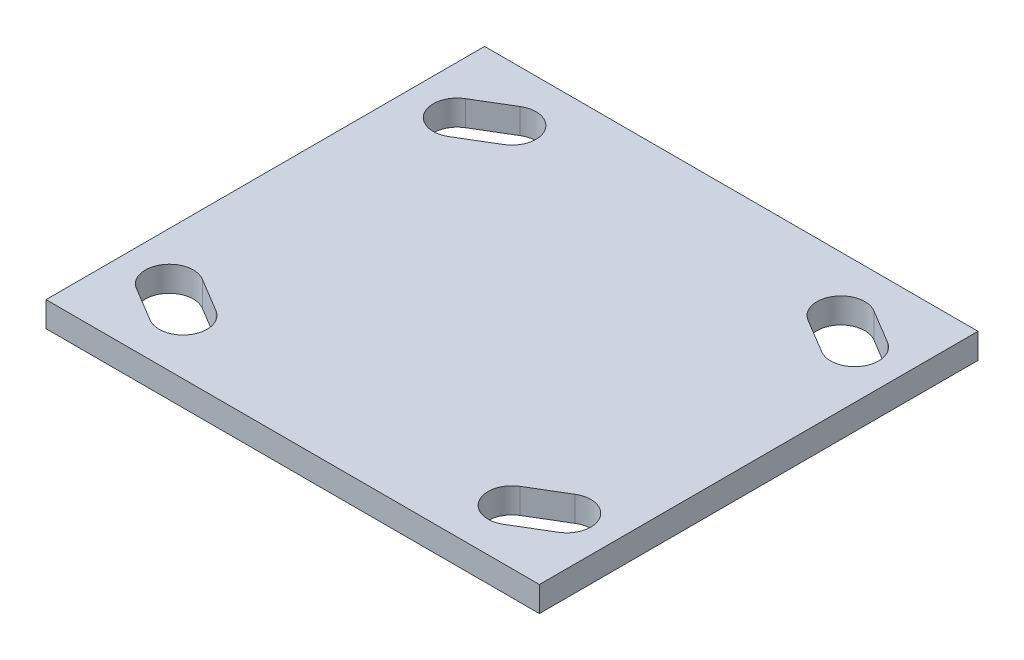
from build123d import *

# Parameters (mm, degrees)
SKETCH1_W          = 114.3
SKETCH1_H          = 101.6
EXTRUDE1_DEPTH     = 2.921
CUT_EXTRUDE1_DEPTH = 5.842


with BuildPart() as part:
    # Sketch1 → Extrude1 (new, symmetric)
    with BuildSketch(Plane(origin=(0, 0, 0), x_dir=(1, 0, 0), z_dir=(0, 1, 0))):
        Rectangle(SKETCH1_W, SKETCH1_H)
    extrude(amount=EXTRUDE1_DEPTH, both=True)

    # Sketch2 → Cut-Extrude1 (cut)
    with BuildSketch(Plane(origin=(0, 2.921, 0), x_dir=(-1, 0, 0), z_dir=(0, 1, 0))):
        with BuildLine():
            Line((-43.178832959, 28.573054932), (-35.241332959, 33.335554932))
            ThreePointArc((-35.241332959, 33.335554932), (-33.335554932, 40.958667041), (-40.958667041, 42.864445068))
            Line((-40.958667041, 42.864445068), (-48.896167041, 38.101945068))
            ThreePointArc((-48.896167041, 38.101945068), (-50.801945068, 30.478832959), (-43.178832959, 28.573054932))
        make_face()
        with BuildLine():
            Line((48.896167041, 38.101945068), (40.958667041, 42.864445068))
            ThreePointArc((40.958667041, 42.864445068), (33.335554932, 40.958667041), (35.241332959, 33.335554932))
            Line((35.241332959, 33.335554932), (43.178832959, 28.573054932))
            ThreePointArc((43.178832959, 28.573054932), (50.801945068, 30.478832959), (48.896167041, 38.101945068))
        make_face()
        with BuildLine():
            Line((48.896167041, -38.101945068), (40.958667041, -42.864445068))
            ThreePointArc((40.958667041, -42.864445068), (33.335554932, -40.958667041), (35.241332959, -33.335554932))
            Line((35.241332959, -33.335554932), (43.178832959, -28.573054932))
            ThreePointArc((43.178832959, -28.573054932), (50.801945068, -30.478832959), (48.896167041, -38.101945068))
        make_face()
        with BuildLine():
            Line((-40.958667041, -42.864445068), (-48.896167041, -38.101945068))
            ThreePointArc((-48.896167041, -38.101945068), (-50.801945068, -30.478832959), (-43.178832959, -28.573054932))
            Line((-43.178832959, -28.573054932), (-35.241332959, -33.335554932))
            ThreePointArc((-35.241332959, -33.335554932), (-33.335554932, -40.958667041), (-40.958667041, -42.864445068))
        make_face()
    extrude(amount=-CUT_EXTRUDE1_DEPTH, mode=Mode.SUBTRACT)


solid = part.part
